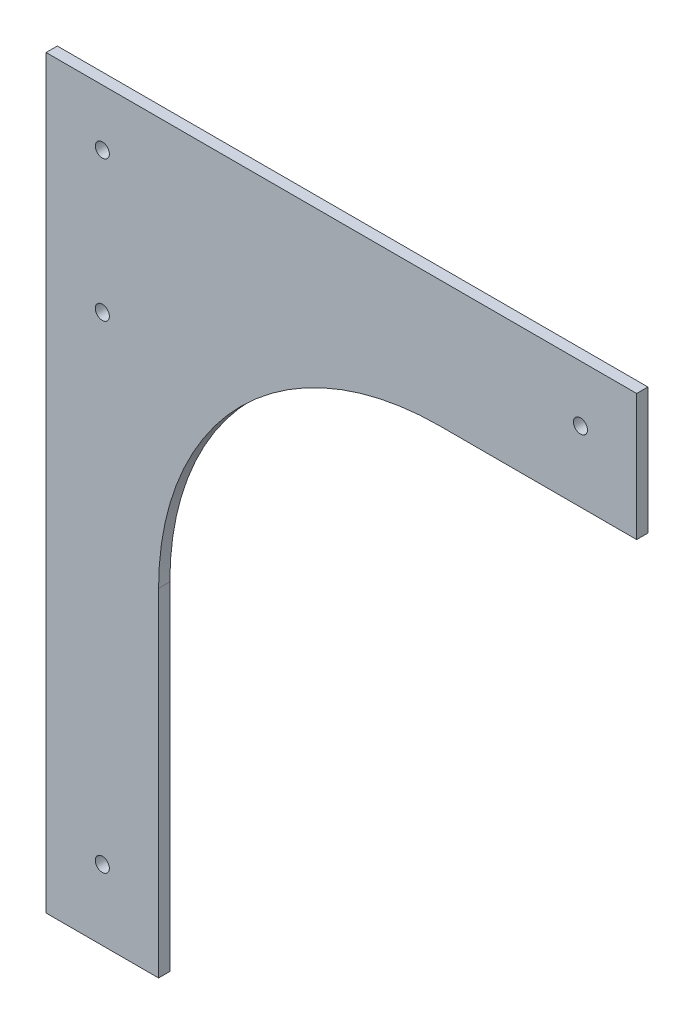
from build123d import *

# Parameters (mm, degrees)
ESQUISSE1_R        = 1.5
BOSS_EXTRU_1_DEPTH = 2.4


with BuildPart() as part:
    # Esquisse1 → Boss.-Extru.1 (new body)
    with BuildSketch(Plane.XY):
        with BuildLine():
            ThreePointArc((-41.25553687, 66), (-83.681943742, 48.426406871), (-101.25553687, 6))
            Line((-101.25553687, 6), (-101.25553687, -66))
            Line((-101.25553687, -66), (-125.25553687, -66))
            Line((-125.25553687, -66), (-125.25553687, 66))
            Line((-125.25553687, 66), (-125.25553687, 93))
            Line((-125.25553687, 93), (0.74446313, 93))
            Line((0.74446313, 93), (0.74446313, 66))
            Line((0.74446313, 66), (-41.25553687, 66))
        make_face()
        with Locations((-11.25553687, 81)):
            Circle(ESQUISSE1_R, mode=Mode.SUBTRACT)
        with Locations((-113.25553687, 81)):
            Circle(ESQUISSE1_R, mode=Mode.SUBTRACT)
        with Locations((-113.25553687, 51)):
            Circle(ESQUISSE1_R, mode=Mode.SUBTRACT)
        with Locations((-113.25553687, -51)):
            Circle(ESQUISSE1_R, mode=Mode.SUBTRACT)
    extrude(amount=BOSS_EXTRU_1_DEPTH)


solid = part.part
